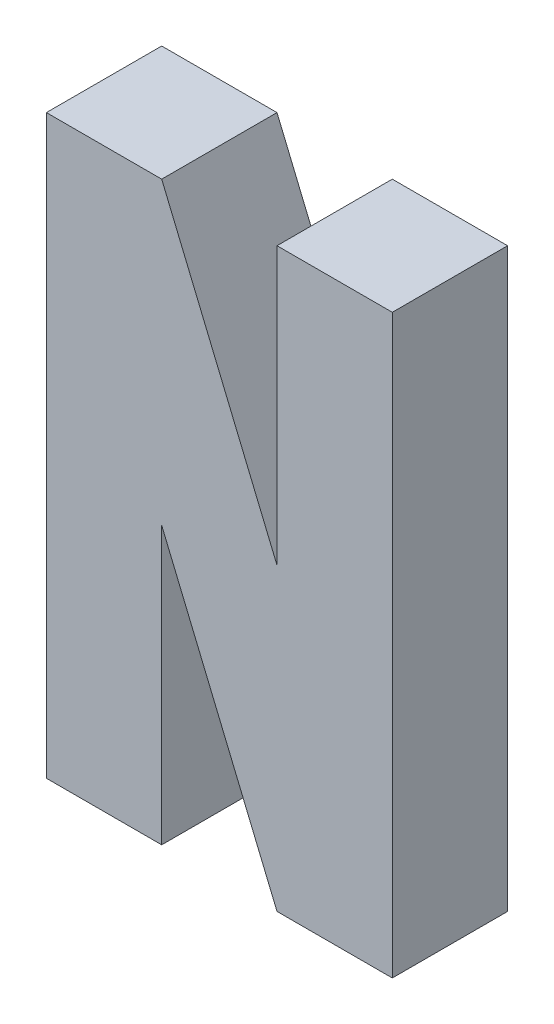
from build123d import *

# Parameters (mm, degrees)
BOSS_EXTRU_1_DEPTH = 10


with BuildPart() as part:
    # Esquisse1 → Boss.-Extru.1 (new body)
    with BuildSketch(Plane.XY):
        Polygon((10, 50), (20, 26), (20, 50), (30, 50), (30, 0), (20, 0), (10, 24), (10, 0), (0, 0), (0, 50), align=None)
    extrude(amount=BOSS_EXTRU_1_DEPTH)


solid = part.part
